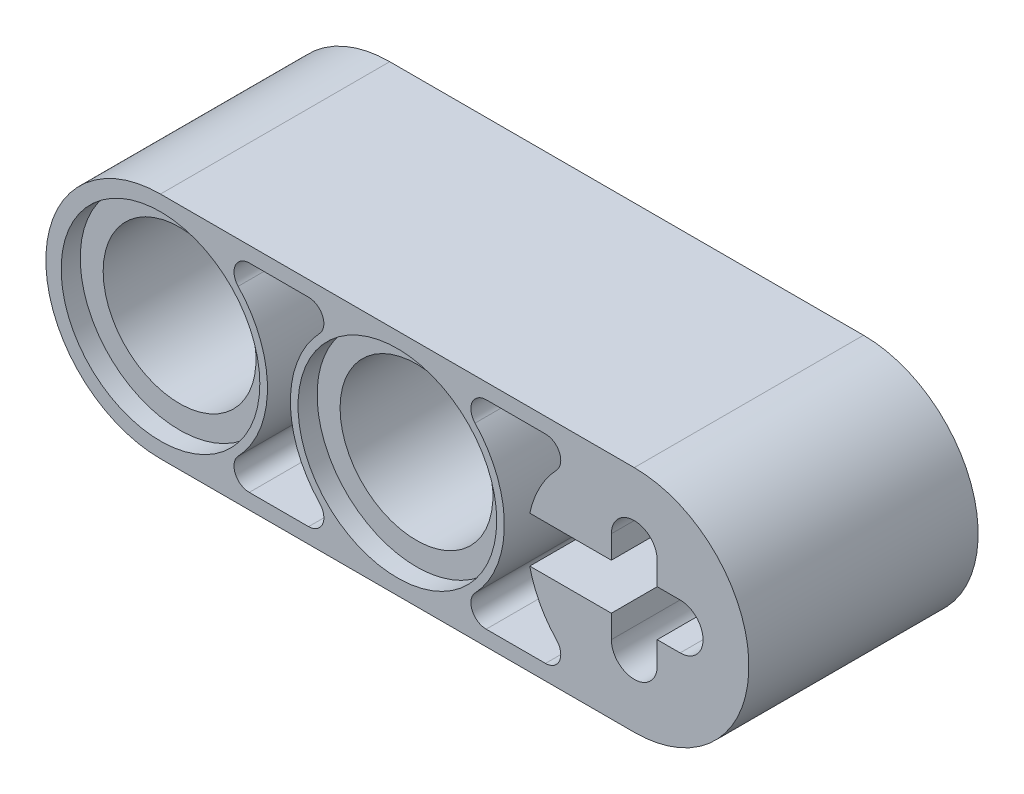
from build123d import *

# Parameters (mm, degrees)
SKETCH1_R           = 2.54
BOSS_EXTRUDE1_DEPTH = 3.81
SKETCH2_R           = 3.302
CUT_EXTRUDE3_DEPTH  = 0.635


with BuildPart() as part:
    # Sketch1 → Boss-Extrude1 (new body)
    with BuildSketch(Plane.XY):
        with BuildLine():
            ThreePointArc((7.874, -3.81), (11.684, 0), (7.874, 3.81))
            Line((7.874, 3.81), (-7.874, 3.81))
            ThreePointArc((-7.874, 3.81), (-11.684, 0), (-7.874, -3.81))
            Line((-7.874, -3.81), (7.874, -3.81))
        make_face()
        with BuildLine():
            ThreePointArc((-2.95121331, 3.302), (-2.484585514, 2.994804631), (-2.582311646, 2.44475))
            ThreePointArc((-2.582311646, 2.44475), (-3.556, 0), (-2.582311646, -2.44475))
            ThreePointArc((-2.582311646, -2.44475), (-2.484585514, -2.994804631), (-2.95121331, -3.302))
            Line((-2.95121331, -3.302), (-4.92278669, -3.302))
            ThreePointArc((-4.92278669, -3.302), (-5.389414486, -2.994804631), (-5.291688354, -2.44475))
            ThreePointArc((-5.291688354, -2.44475), (-4.318, 0), (-5.291688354, 2.44475))
            ThreePointArc((-5.291688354, 2.44475), (-5.389414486, 2.994804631), (-4.92278669, 3.302))
            Line((-4.92278669, 3.302), (-2.95121331, 3.302))
        make_face(mode=Mode.SUBTRACT)
        with Locations(Location((0, 0, 0), (0, 0, 180))):
            Circle(SKETCH1_R, mode=Mode.SUBTRACT)
        with BuildLine():
            Line((4.92278669, -3.302), (2.95121331, -3.302))
            ThreePointArc((2.95121331, -3.302), (2.484585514, -2.994804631), (2.582311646, -2.44475))
            ThreePointArc((2.582311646, -2.44475), (3.556, 0), (2.582311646, 2.44475))
            ThreePointArc((2.582311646, 2.44475), (2.484585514, 2.994804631), (2.95121331, 3.302))
            Line((2.95121331, 3.302), (4.92278669, 3.302))
            ThreePointArc((4.92278669, 3.302), (5.389414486, 2.994804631), (5.291688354, 2.44475))
            ThreePointArc((5.291688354, 2.44475), (4.731418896, 1.664127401), (4.40060224, 0.762))
            Line((4.40060224, 0.762), (7.112, 0.762))
            Line((7.112, 0.762), (7.112, 1.524))
            ThreePointArc((7.112, 1.524), (7.874, 2.286), (8.636, 1.524))
            Line((8.636, 1.524), (8.636, 0.762))
            Line((8.636, 0.762), (9.398, 0.762))
            ThreePointArc((9.398, 0.762), (10.16, 0), (9.398, -0.762))
            Line((9.398, -0.762), (8.636, -0.762))
            Line((8.636, -0.762), (8.636, -1.524))
            ThreePointArc((8.636, -1.524), (7.874, -2.286), (7.112, -1.524))
            Line((7.112, -1.524), (7.112, -0.762))
            Line((7.112, -0.762), (4.40060224, -0.762))
            ThreePointArc((4.40060224, -0.762), (4.731418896, -1.664127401), (5.291688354, -2.44475))
            ThreePointArc((5.291688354, -2.44475), (5.389414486, -2.994804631), (4.92278669, -3.302))
        make_face(mode=Mode.SUBTRACT)
        with Locations(Location((-7.874, 0, 0), (0, 0, 180))):
            Circle(SKETCH1_R, mode=Mode.SUBTRACT)
    extrude(amount=BOSS_EXTRUDE1_DEPTH)

    # Sketch2 → Cut-Extrude3 (cut)
    with BuildSketch(Plane.XY):
        Circle(SKETCH2_R)
        with Locations((-7.874, 0)):
            Circle(SKETCH2_R)
    extrude(amount=CUT_EXTRUDE3_DEPTH, mode=Mode.SUBTRACT)

    # Mirror1: part across plane


with BuildPart() as part_1:
    add(part.part)
    add(part.part.mirror(Plane(origin=(0, -22.684563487, 3.81), x_dir=(1, 0, 0), z_dir=(0, 0, 1))))


solid = part_1.part
